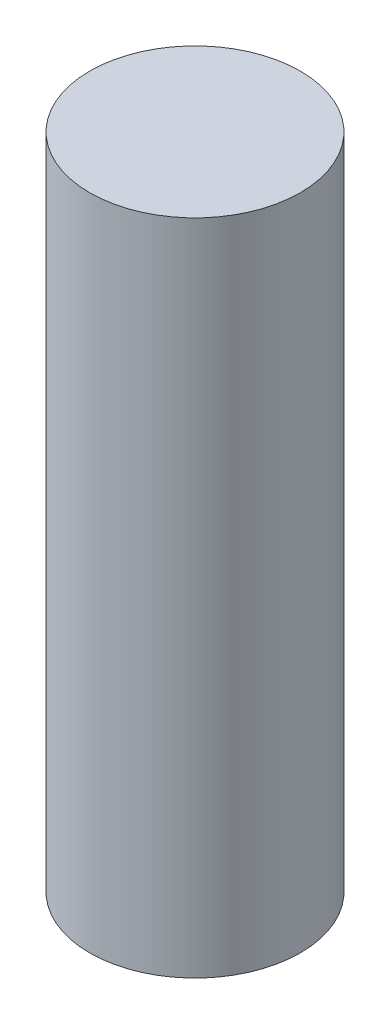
from build123d import *

# Parameters (mm, degrees)
SKIZZE1_R                       = 8
AUFSATZ_LINEAR_AUSTRAGEN1_DEPTH = 50


with BuildPart() as part:
    # Skizze1 → Aufsatz-Linear austragen1 (new body)
    with BuildSketch(Plane(origin=(0, 0, 0), x_dir=(1, 0, 0), z_dir=(0, 1, 0))):
        with Locations(Location((0, 0, 0), (0, 0, 270))):
            Circle(SKIZZE1_R)
    extrude(amount=AUFSATZ_LINEAR_AUSTRAGEN1_DEPTH)


solid = part.part
